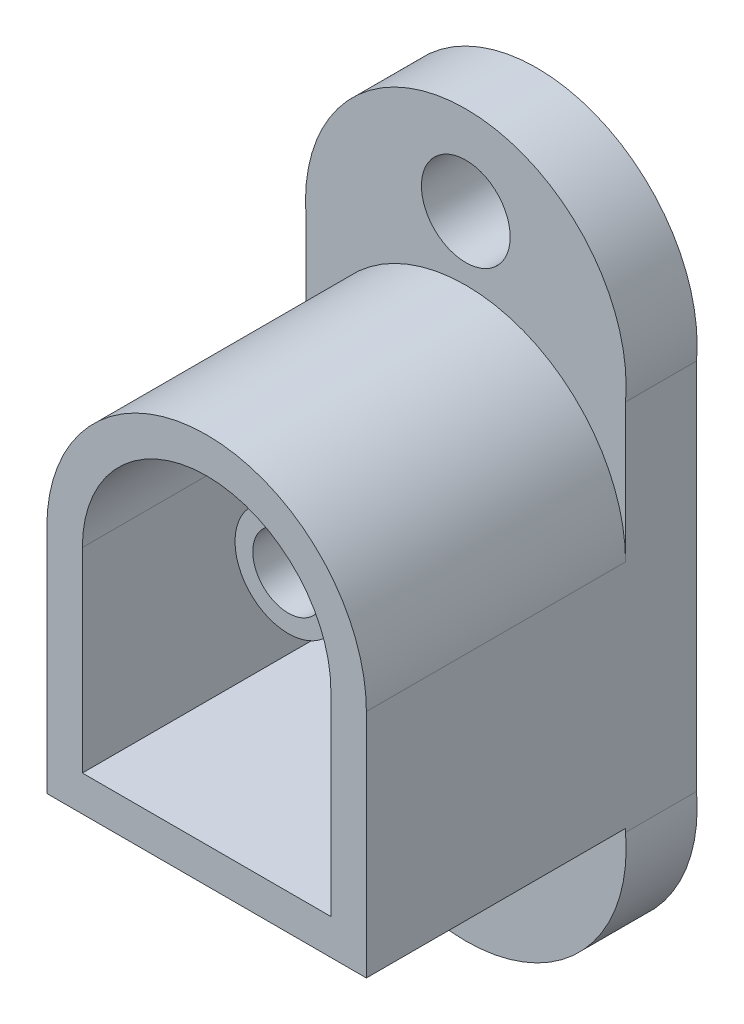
ISO-10303-21;
HEADER;
FILE_DESCRIPTION(('STEP AP214'),'2;1');
FILE_NAME('part.step','',(''),(''),'','','');
FILE_SCHEMA(('AUTOMOTIVE_DESIGN { 1 0 10303 214 1 1 1 1 }'));
ENDSEC;
DATA;
#1=APPLICATION_CONTEXT('core data for automotive mechanical design processes');
#2=APPLICATION_PROTOCOL_DEFINITION('international standard','automotive_design',2000,#1);
#3=PRODUCT_CONTEXT('',#1,'mechanical');
#4=PRODUCT('Part','Part','',(#3));
#5=PRODUCT_RELATED_PRODUCT_CATEGORY('part','',(#4));
#6=PRODUCT_DEFINITION_FORMATION('','',#4);
#7=PRODUCT_DEFINITION_CONTEXT('part definition',#1,'design');
#8=PRODUCT_DEFINITION('design','',#6,#7);
#9=PRODUCT_DEFINITION_SHAPE('','',#8);
#10=(LENGTH_UNIT() NAMED_UNIT(*) SI_UNIT(.MILLI.,.METRE.));
#11=(NAMED_UNIT(*) PLANE_ANGLE_UNIT() SI_UNIT($,.RADIAN.));
#12=(NAMED_UNIT(*) SI_UNIT($,.STERADIAN.) SOLID_ANGLE_UNIT());
#13=UNCERTAINTY_MEASURE_WITH_UNIT(LENGTH_MEASURE(1.E-05),#10,'distance_accuracy_value','');
#14=(GEOMETRIC_REPRESENTATION_CONTEXT(3) GLOBAL_UNCERTAINTY_ASSIGNED_CONTEXT((#13)) GLOBAL_UNIT_ASSIGNED_CONTEXT((#10,
#11,#12)) REPRESENTATION_CONTEXT('',''));
#15=CARTESIAN_POINT('',(0.,0.,0.));
#16=DIRECTION('',(0.,0.,1.));
#17=DIRECTION('',(1.,0.,0.));
#18=AXIS2_PLACEMENT_3D('',#15,#16,#17);
#19=CARTESIAN_POINT('',(0.,5.63367346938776,2.));
#20=DIRECTION('',(0.,0.,-1.));
#21=DIRECTION('',(-1.,0.,0.));
#22=AXIS2_PLACEMENT_3D('',#19,#20,#21);
#23=PLANE('',#22);
#24=DIRECTION('',(0.,1.,0.));
#25=VECTOR('',#24,1.);
#26=CARTESIAN_POINT('',(-3.5,0.,2.));
#27=LINE('',#26,#25);
#28=CARTESIAN_POINT('',(-3.5,-4.15,2.));
#29=VERTEX_POINT('',#28);
#30=CARTESIAN_POINT('',(-3.5,1.35,2.));
#31=VERTEX_POINT('',#30);
#32=EDGE_CURVE('E48',#29,#31,#27,.T.);
#33=ORIENTED_EDGE('',*,*,#32,.F.);
#34=DIRECTION('',(1.,0.,0.));
#35=VECTOR('',#34,1.);
#36=CARTESIAN_POINT('',(0.,-4.15,2.));
#37=LINE('',#36,#35);
#38=CARTESIAN_POINT('',(3.5,-4.15,2.));
#39=VERTEX_POINT('',#38);
#40=EDGE_CURVE('E53',#29,#39,#37,.T.);
#41=ORIENTED_EDGE('',*,*,#40,.T.);
#42=DIRECTION('',(0.,1.,0.));
#43=VECTOR('',#42,1.);
#44=CARTESIAN_POINT('',(3.5,0.,2.));
#45=LINE('',#44,#43);
#46=CARTESIAN_POINT('',(3.5,1.35,2.));
#47=VERTEX_POINT('',#46);
#48=EDGE_CURVE('E148',#39,#47,#45,.T.);
#49=ORIENTED_EDGE('',*,*,#48,.T.);
#50=CARTESIAN_POINT('',(0.,1.35,2.));
#51=DIRECTION('',(0.,0.,1.));
#52=DIRECTION('',(1.,0.,0.));
#53=AXIS2_PLACEMENT_3D('',#50,#51,#52);
#54=CIRCLE('',#53,3.5);
#55=EDGE_CURVE('E253',#31,#47,#54,.F.);
#56=ORIENTED_EDGE('',*,*,#55,.F.);
#57=EDGE_LOOP('',(#33,#41,#49,#56));
#58=FACE_BOUND('',#57,.T.);
#59=CARTESIAN_POINT('',(0.,1.35,2.));
#60=DIRECTION('',(0.,0.,-1.));
#61=DIRECTION('',(-1.,0.,0.));
#62=AXIS2_PLACEMENT_3D('',#59,#60,#61);
#63=CIRCLE('',#62,1.5);
#64=CARTESIAN_POINT('',(-1.5,1.35,2.));
#65=VERTEX_POINT('',#64);
#66=EDGE_CURVE('E11',#65,#65,#63,.F.);
#67=ORIENTED_EDGE('',*,*,#66,.F.);
#68=EDGE_LOOP('',(#67));
#69=FACE_BOUND('',#68,.T.);
#70=ADVANCED_FACE('F33',(#58,#69),#23,.F.);
#71=CARTESIAN_POINT('',(0.,-7.65,2.));
#72=DIRECTION('',(0.,0.,1.));
#73=DIRECTION('',(1.,0.,0.));
#74=AXIS2_PLACEMENT_3D('',#71,#72,#73);
#75=CIRCLE('',#74,1.25);
#76=CARTESIAN_POINT('',(1.25,-7.65,2.));
#77=VERTEX_POINT('',#76);
#78=EDGE_CURVE('E235',#77,#77,#75,.T.);
#79=ORIENTED_EDGE('',*,*,#78,.F.);
#80=EDGE_LOOP('',(#79));
#81=FACE_BOUND('',#80,.T.);
#82=DIRECTION('',(1.,0.,0.));
#83=VECTOR('',#82,1.);
#84=CARTESIAN_POINT('',(0.,-5.15,2.));
#85=LINE('',#84,#83);
#86=CARTESIAN_POINT('',(-4.5,-5.15,2.));
#87=VERTEX_POINT('',#86);
#88=CARTESIAN_POINT('',(4.5,-5.15,2.));
#89=VERTEX_POINT('',#88);
#90=EDGE_CURVE('E175',#87,#89,#85,.T.);
#91=ORIENTED_EDGE('',*,*,#90,.F.);
#92=DIRECTION('',(0.,-1.,0.));
#93=VECTOR('',#92,1.);
#94=CARTESIAN_POINT('',(-4.5,-5.25,2.));
#95=LINE('',#94,#93);
#96=CARTESIAN_POINT('',(-4.5,-5.25,2.));
#97=VERTEX_POINT('',#96);
#98=EDGE_CURVE('E226',#87,#97,#95,.T.);
#99=ORIENTED_EDGE('',*,*,#98,.T.);
#100=CARTESIAN_POINT('',(0.,-5.63367346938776,2.));
#101=DIRECTION('',(0.,0.,1.));
#102=DIRECTION('',(1.,0.,0.));
#103=AXIS2_PLACEMENT_3D('',#100,#101,#102);
#104=CIRCLE('',#103,4.51632653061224);
#105=CARTESIAN_POINT('',(4.5,-5.25,2.));
#106=VERTEX_POINT('',#105);
#107=EDGE_CURVE('E196',#97,#106,#104,.T.);
#108=ORIENTED_EDGE('',*,*,#107,.T.);
#109=DIRECTION('',(0.,1.,0.));
#110=VECTOR('',#109,1.);
#111=CARTESIAN_POINT('',(4.5,-5.25,2.));
#112=LINE('',#111,#110);
#113=EDGE_CURVE('E195',#106,#89,#112,.T.);
#114=ORIENTED_EDGE('',*,*,#113,.T.);
#115=EDGE_LOOP('',(#91,#99,#108,#114));
#116=FACE_BOUND('',#115,.T.);
#117=ADVANCED_FACE('F284',(#81,#116),#23,.F.);
#118=CARTESIAN_POINT('',(0.,7.65,2.));
#119=DIRECTION('',(0.,0.,1.));
#120=DIRECTION('',(1.,0.,0.));
#121=AXIS2_PLACEMENT_3D('',#118,#119,#120);
#122=CIRCLE('',#121,1.25);
#123=CARTESIAN_POINT('',(1.25,7.65,2.));
#124=VERTEX_POINT('',#123);
#125=EDGE_CURVE('E207',#124,#124,#122,.T.);
#126=ORIENTED_EDGE('',*,*,#125,.F.);
#127=EDGE_LOOP('',(#126));
#128=FACE_BOUND('',#127,.T.);
#129=CARTESIAN_POINT('',(-4.5,5.25,2.));
#130=VERTEX_POINT('',#129);
#131=CARTESIAN_POINT('',(-4.5,1.35,2.));
#132=VERTEX_POINT('',#131);
#133=EDGE_CURVE('E225',#130,#132,#95,.T.);
#134=ORIENTED_EDGE('',*,*,#133,.T.);
#135=CARTESIAN_POINT('',(0.,1.35,2.));
#136=DIRECTION('',(0.,0.,1.));
#137=DIRECTION('',(1.,0.,0.));
#138=AXIS2_PLACEMENT_3D('',#135,#136,#137);
#139=CIRCLE('',#138,4.5);
#140=CARTESIAN_POINT('',(4.5,1.35,2.));
#141=VERTEX_POINT('',#140);
#142=EDGE_CURVE('E128',#132,#141,#139,.F.);
#143=ORIENTED_EDGE('',*,*,#142,.T.);
#144=CARTESIAN_POINT('',(4.5,5.25,2.));
#145=VERTEX_POINT('',#144);
#146=EDGE_CURVE('E192',#141,#145,#112,.T.);
#147=ORIENTED_EDGE('',*,*,#146,.T.);
#148=CARTESIAN_POINT('',(0.,5.63367346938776,2.));
#149=DIRECTION('',(0.,0.,1.));
#150=DIRECTION('',(-1.,0.,0.));
#151=AXIS2_PLACEMENT_3D('',#148,#149,#150);
#152=CIRCLE('',#151,4.51632653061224);
#153=EDGE_CURVE('E213',#145,#130,#152,.T.);
#154=ORIENTED_EDGE('',*,*,#153,.T.);
#155=EDGE_LOOP('',(#134,#143,#147,#154));
#156=FACE_BOUND('',#155,.T.);
#157=ADVANCED_FACE('F286',(#128,#156),#23,.F.);
#158=CARTESIAN_POINT('',(0.,5.63367346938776,0.));
#159=DIRECTION('',(0.,0.,-1.));
#160=DIRECTION('',(-1.,0.,0.));
#161=AXIS2_PLACEMENT_3D('',#158,#159,#160);
#162=PLANE('',#161);
#163=CARTESIAN_POINT('',(0.,7.65,0.));
#164=DIRECTION('',(0.,0.,1.));
#165=DIRECTION('',(1.,0.,0.));
#166=AXIS2_PLACEMENT_3D('',#163,#164,#165);
#167=CIRCLE('',#166,1.25);
#168=CARTESIAN_POINT('',(1.25,7.65,0.));
#169=VERTEX_POINT('',#168);
#170=EDGE_CURVE('E232',#169,#169,#167,.T.);
#171=ORIENTED_EDGE('',*,*,#170,.T.);
#172=EDGE_LOOP('',(#171));
#173=FACE_BOUND('',#172,.T.);
#174=CARTESIAN_POINT('',(0.,5.63367346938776,0.));
#175=DIRECTION('',(0.,0.,1.));
#176=DIRECTION('',(-1.,0.,0.));
#177=AXIS2_PLACEMENT_3D('',#174,#175,#176);
#178=CIRCLE('',#177,4.51632653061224);
#179=CARTESIAN_POINT('',(4.5,5.25,0.));
#180=VERTEX_POINT('',#179);
#181=CARTESIAN_POINT('',(-4.5,5.25,0.));
#182=VERTEX_POINT('',#181);
#183=EDGE_CURVE('E202',#180,#182,#178,.T.);
#184=ORIENTED_EDGE('',*,*,#183,.F.);
#185=DIRECTION('',(0.,1.,0.));
#186=VECTOR('',#185,1.);
#187=CARTESIAN_POINT('',(4.5,-5.25,0.));
#188=LINE('',#187,#186);
#189=CARTESIAN_POINT('',(4.5,-5.25,0.));
#190=VERTEX_POINT('',#189);
#191=EDGE_CURVE('E211',#190,#180,#188,.T.);
#192=ORIENTED_EDGE('',*,*,#191,.F.);
#193=CARTESIAN_POINT('',(0.,-5.63367346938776,0.));
#194=DIRECTION('',(0.,0.,1.));
#195=DIRECTION('',(1.,0.,0.));
#196=AXIS2_PLACEMENT_3D('',#193,#194,#195);
#197=CIRCLE('',#196,4.51632653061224);
#198=CARTESIAN_POINT('',(-4.5,-5.25,0.));
#199=VERTEX_POINT('',#198);
#200=EDGE_CURVE('E209',#199,#190,#197,.T.);
#201=ORIENTED_EDGE('',*,*,#200,.F.);
#202=DIRECTION('',(0.,-1.,0.));
#203=VECTOR('',#202,1.);
#204=CARTESIAN_POINT('',(-4.5,-5.25,0.));
#205=LINE('',#204,#203);
#206=EDGE_CURVE('E206',#182,#199,#205,.T.);
#207=ORIENTED_EDGE('',*,*,#206,.F.);
#208=EDGE_LOOP('',(#184,#192,#201,#207));
#209=FACE_BOUND('',#208,.T.);
#210=CARTESIAN_POINT('',(0.,-7.65,0.));
#211=DIRECTION('',(0.,0.,1.));
#212=DIRECTION('',(1.,0.,0.));
#213=AXIS2_PLACEMENT_3D('',#210,#211,#212);
#214=CIRCLE('',#213,1.25);
#215=CARTESIAN_POINT('',(1.25,-7.65,0.));
#216=VERTEX_POINT('',#215);
#217=EDGE_CURVE('E238',#216,#216,#214,.T.);
#218=ORIENTED_EDGE('',*,*,#217,.T.);
#219=EDGE_LOOP('',(#218));
#220=FACE_BOUND('',#219,.T.);
#221=ADVANCED_FACE('F295',(#173,#209,#220),#162,.T.);
#222=CARTESIAN_POINT('',(0.,5.63367346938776,2.));
#223=DIRECTION('',(0.,0.,-1.));
#224=DIRECTION('',(-1.,0.,0.));
#225=AXIS2_PLACEMENT_3D('',#222,#223,#224);
#226=CYLINDRICAL_SURFACE('',#225,4.51632653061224);
#227=ORIENTED_EDGE('',*,*,#183,.T.);
#228=DIRECTION('',(0.,0.,-1.));
#229=VECTOR('',#228,1.);
#230=CARTESIAN_POINT('',(-4.5,5.25,2.));
#231=LINE('',#230,#229);
#232=EDGE_CURVE('E41',#130,#182,#231,.T.);
#233=ORIENTED_EDGE('',*,*,#232,.F.);
#234=ORIENTED_EDGE('',*,*,#153,.F.);
#235=DIRECTION('',(0.,0.,-1.));
#236=VECTOR('',#235,1.);
#237=CARTESIAN_POINT('',(4.5,5.25,2.));
#238=LINE('',#237,#236);
#239=EDGE_CURVE('E214',#145,#180,#238,.T.);
#240=ORIENTED_EDGE('',*,*,#239,.T.);
#241=EDGE_LOOP('',(#227,#233,#234,#240));
#242=FACE_BOUND('',#241,.T.);
#243=ADVANCED_FACE('F35',(#242),#226,.T.);
#244=CARTESIAN_POINT('',(-4.5,-5.25,2.));
#245=DIRECTION('',(1.,0.,0.));
#246=DIRECTION('',(0.,0.,-1.));
#247=AXIS2_PLACEMENT_3D('',#244,#245,#246);
#248=PLANE('',#247);
#249=ORIENTED_EDGE('',*,*,#206,.T.);
#250=DIRECTION('',(0.,0.,-1.));
#251=VECTOR('',#250,1.);
#252=CARTESIAN_POINT('',(-4.5,-5.25,2.));
#253=LINE('',#252,#251);
#254=EDGE_CURVE('E220',#97,#199,#253,.T.);
#255=ORIENTED_EDGE('',*,*,#254,.F.);
#256=ORIENTED_EDGE('',*,*,#98,.F.);
#257=DIRECTION('',(0.,0.,-1.));
#258=VECTOR('',#257,1.);
#259=CARTESIAN_POINT('',(-4.5,-5.15,9.3));
#260=LINE('',#259,#258);
#261=CARTESIAN_POINT('',(-4.5,-5.15,9.3));
#262=VERTEX_POINT('',#261);
#263=EDGE_CURVE('E131',#262,#87,#260,.T.);
#264=ORIENTED_EDGE('',*,*,#263,.F.);
#265=DIRECTION('',(0.,-1.,0.));
#266=VECTOR('',#265,1.);
#267=CARTESIAN_POINT('',(-4.5,0.,9.3));
#268=LINE('',#267,#266);
#269=CARTESIAN_POINT('',(-4.5,1.35,9.3));
#270=VERTEX_POINT('',#269);
#271=EDGE_CURVE('E134',#270,#262,#268,.T.);
#272=ORIENTED_EDGE('',*,*,#271,.F.);
#273=DIRECTION('',(0.,0.,-1.));
#274=VECTOR('',#273,1.);
#275=CARTESIAN_POINT('',(-4.5,1.35,9.3));
#276=LINE('',#275,#274);
#277=EDGE_CURVE('E122',#270,#132,#276,.T.);
#278=ORIENTED_EDGE('',*,*,#277,.T.);
#279=ORIENTED_EDGE('',*,*,#133,.F.);
#280=ORIENTED_EDGE('',*,*,#232,.T.);
#281=EDGE_LOOP('',(#249,#255,#256,#264,#272,#278,#279,#280));
#282=FACE_BOUND('',#281,.T.);
#283=ADVANCED_FACE('F135',(#282),#248,.F.);
#284=CARTESIAN_POINT('',(0.,-5.63367346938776,2.));
#285=DIRECTION('',(0.,0.,-1.));
#286=DIRECTION('',(-1.,0.,0.));
#287=AXIS2_PLACEMENT_3D('',#284,#285,#286);
#288=CYLINDRICAL_SURFACE('',#287,4.51632653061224);
#289=ORIENTED_EDGE('',*,*,#200,.T.);
#290=DIRECTION('',(0.,0.,-1.));
#291=VECTOR('',#290,1.);
#292=CARTESIAN_POINT('',(4.5,-5.25,2.));
#293=LINE('',#292,#291);
#294=EDGE_CURVE('E217',#106,#190,#293,.T.);
#295=ORIENTED_EDGE('',*,*,#294,.F.);
#296=ORIENTED_EDGE('',*,*,#107,.F.);
#297=ORIENTED_EDGE('',*,*,#254,.T.);
#298=EDGE_LOOP('',(#289,#295,#296,#297));
#299=FACE_BOUND('',#298,.T.);
#300=ADVANCED_FACE('F359',(#299),#288,.T.);
#301=CARTESIAN_POINT('',(4.5,-5.25,2.));
#302=DIRECTION('',(-1.,0.,0.));
#303=DIRECTION('',(0.,0.,1.));
#304=AXIS2_PLACEMENT_3D('',#301,#302,#303);
#305=PLANE('',#304);
#306=ORIENTED_EDGE('',*,*,#191,.T.);
#307=ORIENTED_EDGE('',*,*,#239,.F.);
#308=ORIENTED_EDGE('',*,*,#146,.F.);
#309=DIRECTION('',(0.,0.,-1.));
#310=VECTOR('',#309,1.);
#311=CARTESIAN_POINT('',(4.5,1.35,9.3));
#312=LINE('',#311,#310);
#313=CARTESIAN_POINT('',(4.5,1.35,9.3));
#314=VERTEX_POINT('',#313);
#315=EDGE_CURVE('E167',#314,#141,#312,.T.);
#316=ORIENTED_EDGE('',*,*,#315,.F.);
#317=DIRECTION('',(0.,1.,0.));
#318=VECTOR('',#317,1.);
#319=CARTESIAN_POINT('',(4.5,0.,9.3));
#320=LINE('',#319,#318);
#321=CARTESIAN_POINT('',(4.5,-5.15,9.3));
#322=VERTEX_POINT('',#321);
#323=EDGE_CURVE('E145',#322,#314,#320,.T.);
#324=ORIENTED_EDGE('',*,*,#323,.F.);
#325=DIRECTION('',(0.,0.,-1.));
#326=VECTOR('',#325,1.);
#327=CARTESIAN_POINT('',(4.5,-5.15,9.3));
#328=LINE('',#327,#326);
#329=EDGE_CURVE('E177',#322,#89,#328,.T.);
#330=ORIENTED_EDGE('',*,*,#329,.T.);
#331=ORIENTED_EDGE('',*,*,#113,.F.);
#332=ORIENTED_EDGE('',*,*,#294,.T.);
#333=EDGE_LOOP('',(#306,#307,#308,#316,#324,#330,#331,#332));
#334=FACE_BOUND('',#333,.T.);
#335=ADVANCED_FACE('F370',(#334),#305,.F.);
#336=CARTESIAN_POINT('',(0.,7.65,2.));
#337=DIRECTION('',(0.,0.,-1.));
#338=DIRECTION('',(-1.,0.,0.));
#339=AXIS2_PLACEMENT_3D('',#336,#337,#338);
#340=CYLINDRICAL_SURFACE('',#339,1.25);
#341=ORIENTED_EDGE('',*,*,#125,.T.);
#342=EDGE_LOOP('',(#341));
#343=FACE_BOUND('',#342,.T.);
#344=ORIENTED_EDGE('',*,*,#170,.F.);
#345=EDGE_LOOP('',(#344));
#346=FACE_BOUND('',#345,.T.);
#347=ADVANCED_FACE('F376',(#343,#346),#340,.F.);
#348=CARTESIAN_POINT('',(0.,-7.65,2.));
#349=DIRECTION('',(0.,0.,-1.));
#350=DIRECTION('',(-1.,0.,0.));
#351=AXIS2_PLACEMENT_3D('',#348,#349,#350);
#352=CYLINDRICAL_SURFACE('',#351,1.25);
#353=ORIENTED_EDGE('',*,*,#78,.T.);
#354=EDGE_LOOP('',(#353));
#355=FACE_BOUND('',#354,.T.);
#356=ORIENTED_EDGE('',*,*,#217,.F.);
#357=EDGE_LOOP('',(#356));
#358=FACE_BOUND('',#357,.T.);
#359=ADVANCED_FACE('F344',(#355,#358),#352,.F.);
#360=CARTESIAN_POINT('',(-3.5,0.,9.3));
#361=DIRECTION('',(-1.,0.,0.));
#362=DIRECTION('',(0.,-1.,0.));
#363=AXIS2_PLACEMENT_3D('',#360,#361,#362);
#364=PLANE('',#363);
#365=ORIENTED_EDGE('',*,*,#32,.T.);
#366=DIRECTION('',(0.,0.,-1.));
#367=VECTOR('',#366,1.);
#368=CARTESIAN_POINT('',(-3.5,1.35,9.3));
#369=LINE('',#368,#367);
#370=CARTESIAN_POINT('',(-3.5,1.35,9.3));
#371=VERTEX_POINT('',#370);
#372=EDGE_CURVE('E241',#371,#31,#369,.T.);
#373=ORIENTED_EDGE('',*,*,#372,.F.);
#374=DIRECTION('',(0.,1.,0.));
#375=VECTOR('',#374,1.);
#376=CARTESIAN_POINT('',(-3.5,0.,9.3));
#377=LINE('',#376,#375);
#378=CARTESIAN_POINT('',(-3.5,-4.15,9.3));
#379=VERTEX_POINT('',#378);
#380=EDGE_CURVE('E156',#379,#371,#377,.T.);
#381=ORIENTED_EDGE('',*,*,#380,.F.);
#382=DIRECTION('',(0.,0.,-1.));
#383=VECTOR('',#382,1.);
#384=CARTESIAN_POINT('',(-3.5,-4.15,9.3));
#385=LINE('',#384,#383);
#386=EDGE_CURVE('E130',#379,#29,#385,.T.);
#387=ORIENTED_EDGE('',*,*,#386,.T.);
#388=EDGE_LOOP('',(#365,#373,#381,#387));
#389=FACE_BOUND('',#388,.T.);
#390=ADVANCED_FACE('F257',(#389),#364,.F.);
#391=CARTESIAN_POINT('',(0.,1.35,9.3));
#392=DIRECTION('',(0.,0.,-1.));
#393=DIRECTION('',(-1.,0.,0.));
#394=AXIS2_PLACEMENT_3D('',#391,#392,#393);
#395=CYLINDRICAL_SURFACE('',#394,3.5);
#396=ORIENTED_EDGE('',*,*,#55,.T.);
#397=DIRECTION('',(0.,0.,-1.));
#398=VECTOR('',#397,1.);
#399=CARTESIAN_POINT('',(3.5,1.35,9.3));
#400=LINE('',#399,#398);
#401=CARTESIAN_POINT('',(3.5,1.35,9.3));
#402=VERTEX_POINT('',#401);
#403=EDGE_CURVE('E246',#402,#47,#400,.T.);
#404=ORIENTED_EDGE('',*,*,#403,.F.);
#405=CARTESIAN_POINT('',(0.,1.35,9.3));
#406=DIRECTION('',(0.,0.,1.));
#407=DIRECTION('',(1.,0.,0.));
#408=AXIS2_PLACEMENT_3D('',#405,#406,#407);
#409=CIRCLE('',#408,3.5);
#410=EDGE_CURVE('E159',#371,#402,#409,.F.);
#411=ORIENTED_EDGE('',*,*,#410,.F.);
#412=ORIENTED_EDGE('',*,*,#372,.T.);
#413=EDGE_LOOP('',(#396,#404,#411,#412));
#414=FACE_BOUND('',#413,.T.);
#415=ADVANCED_FACE('F269',(#414),#395,.F.);
#416=CARTESIAN_POINT('',(3.5,0.,9.3));
#417=DIRECTION('',(-1.,0.,0.));
#418=DIRECTION('',(0.,0.,1.));
#419=AXIS2_PLACEMENT_3D('',#416,#417,#418);
#420=PLANE('',#419);
#421=ORIENTED_EDGE('',*,*,#48,.F.);
#422=DIRECTION('',(0.,0.,-1.));
#423=VECTOR('',#422,1.);
#424=CARTESIAN_POINT('',(3.5,-4.15,9.3));
#425=LINE('',#424,#423);
#426=CARTESIAN_POINT('',(3.5,-4.15,9.3));
#427=VERTEX_POINT('',#426);
#428=EDGE_CURVE('E249',#427,#39,#425,.T.);
#429=ORIENTED_EDGE('',*,*,#428,.F.);
#430=DIRECTION('',(0.,1.,0.));
#431=VECTOR('',#430,1.);
#432=CARTESIAN_POINT('',(3.5,0.,9.3));
#433=LINE('',#432,#431);
#434=EDGE_CURVE('E161',#427,#402,#433,.T.);
#435=ORIENTED_EDGE('',*,*,#434,.T.);
#436=ORIENTED_EDGE('',*,*,#403,.T.);
#437=EDGE_LOOP('',(#421,#429,#435,#436));
#438=FACE_BOUND('',#437,.T.);
#439=ADVANCED_FACE('F265',(#438),#420,.T.);
#440=CARTESIAN_POINT('',(0.,1.35,9.3));
#441=DIRECTION('',(0.,0.,-1.));
#442=DIRECTION('',(-1.,0.,0.));
#443=AXIS2_PLACEMENT_3D('',#440,#441,#442);
#444=CYLINDRICAL_SURFACE('',#443,4.5);
#445=ORIENTED_EDGE('',*,*,#142,.F.);
#446=ORIENTED_EDGE('',*,*,#277,.F.);
#447=CARTESIAN_POINT('',(0.,1.35,9.3));
#448=DIRECTION('',(0.,0.,1.));
#449=DIRECTION('',(1.,0.,0.));
#450=AXIS2_PLACEMENT_3D('',#447,#448,#449);
#451=CIRCLE('',#450,4.5);
#452=EDGE_CURVE('E127',#270,#314,#451,.F.);
#453=ORIENTED_EDGE('',*,*,#452,.T.);
#454=ORIENTED_EDGE('',*,*,#315,.T.);
#455=EDGE_LOOP('',(#445,#446,#453,#454));
#456=FACE_BOUND('',#455,.T.);
#457=ADVANCED_FACE('F124',(#456),#444,.T.);
#458=CARTESIAN_POINT('',(0.,-5.15,9.3));
#459=DIRECTION('',(0.,1.,0.));
#460=DIRECTION('',(0.,0.,1.));
#461=AXIS2_PLACEMENT_3D('',#458,#459,#460);
#462=PLANE('',#461);
#463=ORIENTED_EDGE('',*,*,#90,.T.);
#464=ORIENTED_EDGE('',*,*,#329,.F.);
#465=DIRECTION('',(1.,0.,0.));
#466=VECTOR('',#465,1.);
#467=CARTESIAN_POINT('',(0.,-5.15,9.3));
#468=LINE('',#467,#466);
#469=EDGE_CURVE('E140',#262,#322,#468,.T.);
#470=ORIENTED_EDGE('',*,*,#469,.F.);
#471=ORIENTED_EDGE('',*,*,#263,.T.);
#472=EDGE_LOOP('',(#463,#464,#470,#471));
#473=FACE_BOUND('',#472,.T.);
#474=ADVANCED_FACE('F280',(#473),#462,.F.);
#475=CARTESIAN_POINT('',(0.,-4.15,9.3));
#476=DIRECTION('',(0.,1.,0.));
#477=DIRECTION('',(0.,0.,1.));
#478=AXIS2_PLACEMENT_3D('',#475,#476,#477);
#479=PLANE('',#478);
#480=ORIENTED_EDGE('',*,*,#40,.F.);
#481=ORIENTED_EDGE('',*,*,#386,.F.);
#482=DIRECTION('',(1.,0.,0.));
#483=VECTOR('',#482,1.);
#484=CARTESIAN_POINT('',(0.,-4.15,9.3));
#485=LINE('',#484,#483);
#486=EDGE_CURVE('E164',#379,#427,#485,.T.);
#487=ORIENTED_EDGE('',*,*,#486,.T.);
#488=ORIENTED_EDGE('',*,*,#428,.T.);
#489=EDGE_LOOP('',(#480,#481,#487,#488));
#490=FACE_BOUND('',#489,.T.);
#491=ADVANCED_FACE('F261',(#490),#479,.T.);
#492=CARTESIAN_POINT('',(0.,0.,9.3));
#493=DIRECTION('',(0.,0.,1.));
#494=DIRECTION('',(1.,0.,0.));
#495=AXIS2_PLACEMENT_3D('',#492,#493,#494);
#496=PLANE('',#495);
#497=ORIENTED_EDGE('',*,*,#452,.F.);
#498=ORIENTED_EDGE('',*,*,#271,.T.);
#499=ORIENTED_EDGE('',*,*,#469,.T.);
#500=ORIENTED_EDGE('',*,*,#323,.T.);
#501=EDGE_LOOP('',(#497,#498,#499,#500));
#502=FACE_BOUND('',#501,.T.);
#503=ORIENTED_EDGE('',*,*,#380,.T.);
#504=ORIENTED_EDGE('',*,*,#410,.T.);
#505=ORIENTED_EDGE('',*,*,#434,.F.);
#506=ORIENTED_EDGE('',*,*,#486,.F.);
#507=EDGE_LOOP('',(#503,#504,#505,#506));
#508=FACE_BOUND('',#507,.T.);
#509=ADVANCED_FACE('F142',(#502,#508),#496,.T.);
#510=CARTESIAN_POINT('',(0.,1.35,7.));
#511=DIRECTION('',(0.,0.,1.));
#512=DIRECTION('',(1.,0.,0.));
#513=AXIS2_PLACEMENT_3D('',#510,#511,#512);
#514=PLANE('',#513);
#515=CARTESIAN_POINT('',(0.,1.35,7.));
#516=DIRECTION('',(0.,0.,1.));
#517=DIRECTION('',(1.,0.,0.));
#518=AXIS2_PLACEMENT_3D('',#515,#516,#517);
#519=CIRCLE('',#518,1.5);
#520=CARTESIAN_POINT('',(1.5,1.35,7.));
#521=VERTEX_POINT('',#520);
#522=EDGE_CURVE('E151',#521,#521,#519,.T.);
#523=ORIENTED_EDGE('',*,*,#522,.T.);
#524=EDGE_LOOP('',(#523));
#525=FACE_BOUND('',#524,.T.);
#526=CARTESIAN_POINT('',(0.,1.35,7.));
#527=DIRECTION('',(0.,0.,1.));
#528=DIRECTION('',(1.,0.,0.));
#529=AXIS2_PLACEMENT_3D('',#526,#527,#528);
#530=CIRCLE('',#529,1.);
#531=CARTESIAN_POINT('',(1.,1.35,7.));
#532=VERTEX_POINT('',#531);
#533=EDGE_CURVE('E315',#532,#532,#530,.T.);
#534=ORIENTED_EDGE('',*,*,#533,.F.);
#535=EDGE_LOOP('',(#534));
#536=FACE_BOUND('',#535,.T.);
#537=ADVANCED_FACE('F271',(#525,#536),#514,.T.);
#538=CARTESIAN_POINT('',(0.,1.35,7.));
#539=DIRECTION('',(0.,0.,-1.));
#540=DIRECTION('',(-1.,0.,0.));
#541=AXIS2_PLACEMENT_3D('',#538,#539,#540);
#542=CYLINDRICAL_SURFACE('',#541,1.5);
#543=ORIENTED_EDGE('',*,*,#522,.F.);
#544=EDGE_LOOP('',(#543));
#545=FACE_BOUND('',#544,.T.);
#546=ORIENTED_EDGE('',*,*,#66,.T.);
#547=EDGE_LOOP('',(#546));
#548=FACE_BOUND('',#547,.T.);
#549=ADVANCED_FACE('F277',(#545,#548),#542,.T.);
#550=CARTESIAN_POINT('',(0.,1.35,7.));
#551=DIRECTION('',(0.,0.,-1.));
#552=DIRECTION('',(-1.,0.,0.));
#553=AXIS2_PLACEMENT_3D('',#550,#551,#552);
#554=CYLINDRICAL_SURFACE('',#553,1.);
#555=ORIENTED_EDGE('',*,*,#533,.T.);
#556=EDGE_LOOP('',(#555));
#557=FACE_BOUND('',#556,.T.);
#558=CARTESIAN_POINT('',(0.,1.35,2.));
#559=DIRECTION('',(0.,0.,1.));
#560=DIRECTION('',(1.,0.,0.));
#561=AXIS2_PLACEMENT_3D('',#558,#559,#560);
#562=CIRCLE('',#561,1.);
#563=CARTESIAN_POINT('',(1.,1.35,2.));
#564=VERTEX_POINT('',#563);
#565=EDGE_CURVE('E313',#564,#564,#562,.T.);
#566=ORIENTED_EDGE('',*,*,#565,.F.);
#567=EDGE_LOOP('',(#566));
#568=FACE_BOUND('',#567,.T.);
#569=ADVANCED_FACE('F304',(#557,#568),#554,.F.);
#570=ORIENTED_EDGE('',*,*,#565,.T.);
#571=EDGE_LOOP('',(#570));
#572=FACE_BOUND('',#571,.T.);
#573=ADVANCED_FACE('F291',(#572),#23,.F.);
#574=CLOSED_SHELL('',(#70,#117,#157,#221,#243,#283,#300,#335,#347,#359,#390,#415,#439,#457,#474,
#491,#509,#537,#549,#569,#573));
#575=MANIFOLD_SOLID_BREP('B2',#574);
#576=ADVANCED_BREP_SHAPE_REPRESENTATION('',(#18,#575),#14);
#577=SHAPE_DEFINITION_REPRESENTATION(#9,#576);
ENDSEC;
END-ISO-10303-21;
